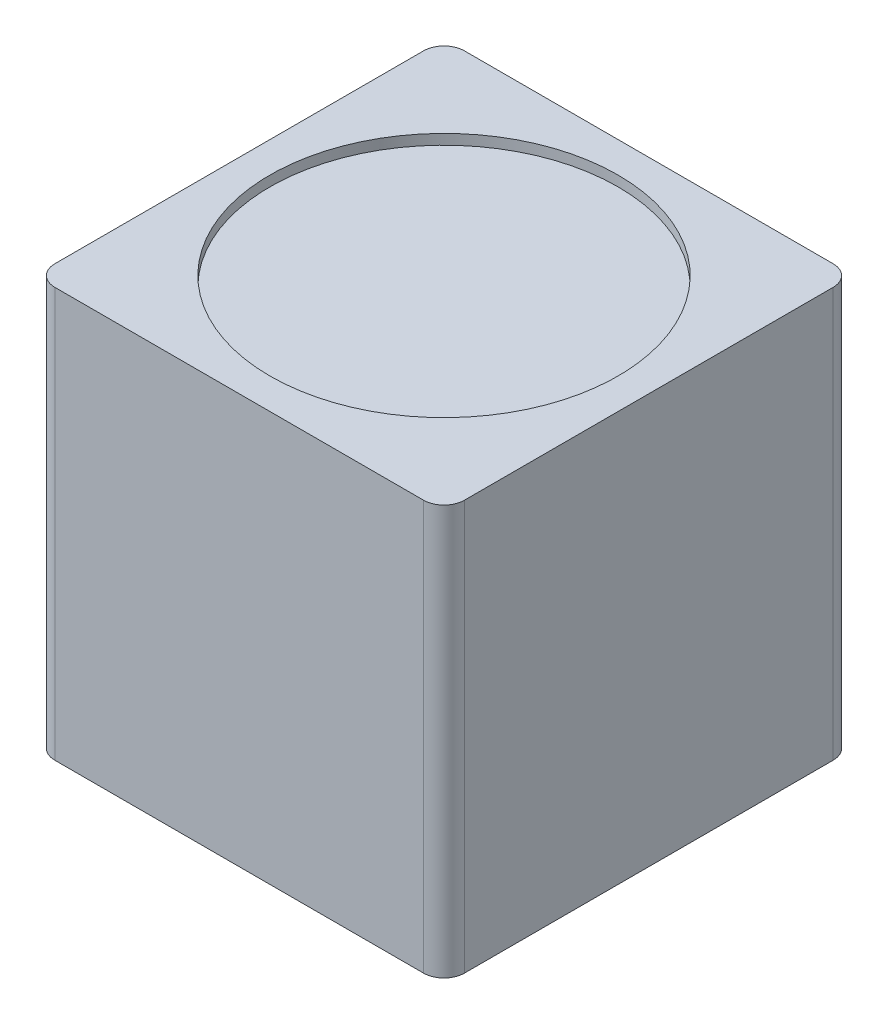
ISO-10303-21;
HEADER;
FILE_DESCRIPTION(('STEP AP214'),'2;1');
FILE_NAME('part.step','',(''),(''),'','','');
FILE_SCHEMA(('AUTOMOTIVE_DESIGN { 1 0 10303 214 1 1 1 1 }'));
ENDSEC;
DATA;
#1=APPLICATION_CONTEXT('core data for automotive mechanical design processes');
#2=APPLICATION_PROTOCOL_DEFINITION('international standard','automotive_design',2000,#1);
#3=PRODUCT_CONTEXT('',#1,'mechanical');
#4=PRODUCT('Part','Part','',(#3));
#5=PRODUCT_RELATED_PRODUCT_CATEGORY('part','',(#4));
#6=PRODUCT_DEFINITION_FORMATION('','',#4);
#7=PRODUCT_DEFINITION_CONTEXT('part definition',#1,'design');
#8=PRODUCT_DEFINITION('design','',#6,#7);
#9=PRODUCT_DEFINITION_SHAPE('','',#8);
#10=(LENGTH_UNIT() NAMED_UNIT(*) SI_UNIT(.MILLI.,.METRE.));
#11=(NAMED_UNIT(*) PLANE_ANGLE_UNIT() SI_UNIT($,.RADIAN.));
#12=(NAMED_UNIT(*) SI_UNIT($,.STERADIAN.) SOLID_ANGLE_UNIT());
#13=UNCERTAINTY_MEASURE_WITH_UNIT(LENGTH_MEASURE(1.E-05),#10,'distance_accuracy_value','');
#14=(GEOMETRIC_REPRESENTATION_CONTEXT(3) GLOBAL_UNCERTAINTY_ASSIGNED_CONTEXT((#13)) GLOBAL_UNIT_ASSIGNED_CONTEXT((#10,
#11,#12)) REPRESENTATION_CONTEXT('',''));
#15=CARTESIAN_POINT('',(0.,0.,0.));
#16=DIRECTION('',(0.,0.,1.));
#17=DIRECTION('',(1.,0.,0.));
#18=AXIS2_PLACEMENT_3D('',#15,#16,#17);
#19=CARTESIAN_POINT('',(0.,20.,20.));
#20=DIRECTION('',(1.,0.,0.));
#21=DIRECTION('',(0.,0.,-1.));
#22=AXIS2_PLACEMENT_3D('',#19,#20,#21);
#23=PLANE('',#22);
#24=DIRECTION('',(0.,0.,-1.));
#25=VECTOR('',#24,1.);
#26=CARTESIAN_POINT('',(0.,20.,20.));
#27=LINE('',#26,#25);
#28=CARTESIAN_POINT('',(0.,20.,19.));
#29=VERTEX_POINT('',#28);
#30=CARTESIAN_POINT('',(0.,20.,1.));
#31=VERTEX_POINT('',#30);
#32=EDGE_CURVE('E165',#29,#31,#27,.T.);
#33=ORIENTED_EDGE('',*,*,#32,.T.);
#34=DIRECTION('',(0.,-1.,0.));
#35=VECTOR('',#34,1.);
#36=CARTESIAN_POINT('',(0.,20.,1.));
#37=LINE('',#36,#35);
#38=CARTESIAN_POINT('',(0.,0.,1.));
#39=VERTEX_POINT('',#38);
#40=EDGE_CURVE('E128',#31,#39,#37,.T.);
#41=ORIENTED_EDGE('',*,*,#40,.T.);
#42=DIRECTION('',(0.,0.,-1.));
#43=VECTOR('',#42,1.);
#44=CARTESIAN_POINT('',(0.,0.,20.));
#45=LINE('',#44,#43);
#46=CARTESIAN_POINT('',(0.,0.,19.));
#47=VERTEX_POINT('',#46);
#48=EDGE_CURVE('E113',#47,#39,#45,.T.);
#49=ORIENTED_EDGE('',*,*,#48,.F.);
#50=DIRECTION('',(0.,-1.,0.));
#51=VECTOR('',#50,1.);
#52=CARTESIAN_POINT('',(0.,20.,19.));
#53=LINE('',#52,#51);
#54=EDGE_CURVE('E125',#47,#29,#53,.F.);
#55=ORIENTED_EDGE('',*,*,#54,.T.);
#56=EDGE_LOOP('',(#33,#41,#49,#55));
#57=FACE_BOUND('',#56,.T.);
#58=ADVANCED_FACE('F43',(#57),#23,.F.);
#59=CARTESIAN_POINT('',(0.,0.,20.));
#60=DIRECTION('',(0.,1.,0.));
#61=DIRECTION('',(0.,0.,1.));
#62=AXIS2_PLACEMENT_3D('',#59,#60,#61);
#63=PLANE('',#62);
#64=ORIENTED_EDGE('',*,*,#48,.T.);
#65=CARTESIAN_POINT('',(1.,0.,1.));
#66=DIRECTION('',(0.,1.,0.));
#67=DIRECTION('',(0.,0.,1.));
#68=AXIS2_PLACEMENT_3D('',#65,#66,#67);
#69=CIRCLE('',#68,1.);
#70=CARTESIAN_POINT('',(1.,0.,0.));
#71=VERTEX_POINT('',#70);
#72=EDGE_CURVE('E141',#39,#71,#69,.F.);
#73=ORIENTED_EDGE('',*,*,#72,.T.);
#74=DIRECTION('',(1.,0.,0.));
#75=VECTOR('',#74,1.);
#76=CARTESIAN_POINT('',(0.,0.,0.));
#77=LINE('',#76,#75);
#78=CARTESIAN_POINT('',(19.,0.,0.));
#79=VERTEX_POINT('',#78);
#80=EDGE_CURVE('E173',#71,#79,#77,.T.);
#81=ORIENTED_EDGE('',*,*,#80,.T.);
#82=CARTESIAN_POINT('',(19.,0.,1.));
#83=DIRECTION('',(0.,1.,0.));
#84=DIRECTION('',(0.,0.,1.));
#85=AXIS2_PLACEMENT_3D('',#82,#83,#84);
#86=CIRCLE('',#85,1.);
#87=CARTESIAN_POINT('',(20.,0.,1.));
#88=VERTEX_POINT('',#87);
#89=EDGE_CURVE('E119',#79,#88,#86,.F.);
#90=ORIENTED_EDGE('',*,*,#89,.T.);
#91=DIRECTION('',(0.,0.,-1.));
#92=VECTOR('',#91,1.);
#93=CARTESIAN_POINT('',(20.,0.,20.));
#94=LINE('',#93,#92);
#95=CARTESIAN_POINT('',(20.,0.,19.));
#96=VERTEX_POINT('',#95);
#97=EDGE_CURVE('E129',#96,#88,#94,.T.);
#98=ORIENTED_EDGE('',*,*,#97,.F.);
#99=CARTESIAN_POINT('',(19.,0.,19.));
#100=DIRECTION('',(0.,1.,0.));
#101=DIRECTION('',(0.,0.,1.));
#102=AXIS2_PLACEMENT_3D('',#99,#100,#101);
#103=CIRCLE('',#102,1.);
#104=CARTESIAN_POINT('',(19.,0.,20.));
#105=VERTEX_POINT('',#104);
#106=EDGE_CURVE('E120',#96,#105,#103,.F.);
#107=ORIENTED_EDGE('',*,*,#106,.T.);
#108=DIRECTION('',(1.,0.,0.));
#109=VECTOR('',#108,1.);
#110=CARTESIAN_POINT('',(0.,0.,20.));
#111=LINE('',#110,#109);
#112=CARTESIAN_POINT('',(1.,0.,20.));
#113=VERTEX_POINT('',#112);
#114=EDGE_CURVE('E115',#113,#105,#111,.T.);
#115=ORIENTED_EDGE('',*,*,#114,.F.);
#116=CARTESIAN_POINT('',(1.,0.,19.));
#117=DIRECTION('',(0.,1.,0.));
#118=DIRECTION('',(0.,0.,1.));
#119=AXIS2_PLACEMENT_3D('',#116,#117,#118);
#120=CIRCLE('',#119,1.);
#121=EDGE_CURVE('E110',#113,#47,#120,.F.);
#122=ORIENTED_EDGE('',*,*,#121,.T.);
#123=EDGE_LOOP('',(#64,#73,#81,#90,#98,#107,#115,#122));
#124=FACE_BOUND('',#123,.T.);
#125=ADVANCED_FACE('F112',(#124),#63,.F.);
#126=CARTESIAN_POINT('',(20.,0.,20.));
#127=DIRECTION('',(-1.,0.,0.));
#128=DIRECTION('',(0.,0.,1.));
#129=AXIS2_PLACEMENT_3D('',#126,#127,#128);
#130=PLANE('',#129);
#131=ORIENTED_EDGE('',*,*,#97,.T.);
#132=DIRECTION('',(0.,1.,0.));
#133=VECTOR('',#132,1.);
#134=CARTESIAN_POINT('',(20.,0.,1.));
#135=LINE('',#134,#133);
#136=CARTESIAN_POINT('',(20.,20.,1.));
#137=VERTEX_POINT('',#136);
#138=EDGE_CURVE('E154',#88,#137,#135,.T.);
#139=ORIENTED_EDGE('',*,*,#138,.T.);
#140=DIRECTION('',(0.,0.,-1.));
#141=VECTOR('',#140,1.);
#142=CARTESIAN_POINT('',(20.,20.,20.));
#143=LINE('',#142,#141);
#144=CARTESIAN_POINT('',(20.,20.,19.));
#145=VERTEX_POINT('',#144);
#146=EDGE_CURVE('E167',#145,#137,#143,.T.);
#147=ORIENTED_EDGE('',*,*,#146,.F.);
#148=DIRECTION('',(0.,1.,0.));
#149=VECTOR('',#148,1.);
#150=CARTESIAN_POINT('',(20.,0.,19.));
#151=LINE('',#150,#149);
#152=EDGE_CURVE('E152',#145,#96,#151,.F.);
#153=ORIENTED_EDGE('',*,*,#152,.T.);
#154=EDGE_LOOP('',(#131,#139,#147,#153));
#155=FACE_BOUND('',#154,.T.);
#156=ADVANCED_FACE('F181',(#155),#130,.F.);
#157=CARTESIAN_POINT('',(20.,20.,20.));
#158=DIRECTION('',(0.,-1.,0.));
#159=DIRECTION('',(0.,0.,-1.));
#160=AXIS2_PLACEMENT_3D('',#157,#158,#159);
#161=PLANE('',#160);
#162=CARTESIAN_POINT('',(10.,20.,10.));
#163=DIRECTION('',(0.,-1.,0.));
#164=DIRECTION('',(0.,0.,-1.));
#165=AXIS2_PLACEMENT_3D('',#162,#163,#164);
#166=CIRCLE('',#165,8.5);
#167=CARTESIAN_POINT('',(10.,20.,1.5));
#168=VERTEX_POINT('',#167);
#169=EDGE_CURVE('E137',#168,#168,#166,.F.);
#170=ORIENTED_EDGE('',*,*,#169,.F.);
#171=EDGE_LOOP('',(#170));
#172=FACE_BOUND('',#171,.T.);
#173=DIRECTION('',(-1.,0.,0.));
#174=VECTOR('',#173,1.);
#175=CARTESIAN_POINT('',(20.,20.,0.));
#176=LINE('',#175,#174);
#177=CARTESIAN_POINT('',(19.,20.,0.));
#178=VERTEX_POINT('',#177);
#179=CARTESIAN_POINT('',(1.,20.,0.));
#180=VERTEX_POINT('',#179);
#181=EDGE_CURVE('E169',#178,#180,#176,.T.);
#182=ORIENTED_EDGE('',*,*,#181,.T.);
#183=CARTESIAN_POINT('',(1.,20.,1.));
#184=DIRECTION('',(0.,-1.,0.));
#185=DIRECTION('',(0.,0.,-1.));
#186=AXIS2_PLACEMENT_3D('',#183,#184,#185);
#187=CIRCLE('',#186,1.);
#188=EDGE_CURVE('E150',#180,#31,#187,.F.);
#189=ORIENTED_EDGE('',*,*,#188,.T.);
#190=ORIENTED_EDGE('',*,*,#32,.F.);
#191=CARTESIAN_POINT('',(1.,20.,19.));
#192=DIRECTION('',(0.,-1.,0.));
#193=DIRECTION('',(0.,0.,-1.));
#194=AXIS2_PLACEMENT_3D('',#191,#192,#193);
#195=CIRCLE('',#194,1.);
#196=CARTESIAN_POINT('',(1.,20.,20.));
#197=VERTEX_POINT('',#196);
#198=EDGE_CURVE('E133',#29,#197,#195,.F.);
#199=ORIENTED_EDGE('',*,*,#198,.T.);
#200=DIRECTION('',(-1.,0.,0.));
#201=VECTOR('',#200,1.);
#202=CARTESIAN_POINT('',(20.,20.,20.));
#203=LINE('',#202,#201);
#204=CARTESIAN_POINT('',(19.,20.,20.));
#205=VERTEX_POINT('',#204);
#206=EDGE_CURVE('E160',#205,#197,#203,.T.);
#207=ORIENTED_EDGE('',*,*,#206,.F.);
#208=CARTESIAN_POINT('',(19.,20.,19.));
#209=DIRECTION('',(0.,-1.,0.));
#210=DIRECTION('',(0.,0.,-1.));
#211=AXIS2_PLACEMENT_3D('',#208,#209,#210);
#212=CIRCLE('',#211,1.);
#213=EDGE_CURVE('E66',#205,#145,#212,.F.);
#214=ORIENTED_EDGE('',*,*,#213,.T.);
#215=ORIENTED_EDGE('',*,*,#146,.T.);
#216=CARTESIAN_POINT('',(19.,20.,1.));
#217=DIRECTION('',(0.,-1.,0.));
#218=DIRECTION('',(0.,0.,-1.));
#219=AXIS2_PLACEMENT_3D('',#216,#217,#218);
#220=CIRCLE('',#219,1.);
#221=EDGE_CURVE('E58',#137,#178,#220,.F.);
#222=ORIENTED_EDGE('',*,*,#221,.T.);
#223=EDGE_LOOP('',(#182,#189,#190,#199,#207,#214,#215,#222));
#224=FACE_BOUND('',#223,.T.);
#225=ADVANCED_FACE('F164',(#172,#224),#161,.F.);
#226=CARTESIAN_POINT('',(0.,0.,20.));
#227=DIRECTION('',(0.,0.,1.));
#228=DIRECTION('',(1.,0.,0.));
#229=AXIS2_PLACEMENT_3D('',#226,#227,#228);
#230=PLANE('',#229);
#231=ORIENTED_EDGE('',*,*,#206,.T.);
#232=DIRECTION('',(0.,-1.,0.));
#233=VECTOR('',#232,1.);
#234=CARTESIAN_POINT('',(1.,0.,20.));
#235=LINE('',#234,#233);
#236=EDGE_CURVE('E11',#197,#113,#235,.T.);
#237=ORIENTED_EDGE('',*,*,#236,.T.);
#238=ORIENTED_EDGE('',*,*,#114,.T.);
#239=DIRECTION('',(0.,1.,0.));
#240=VECTOR('',#239,1.);
#241=CARTESIAN_POINT('',(19.,20.,20.));
#242=LINE('',#241,#240);
#243=EDGE_CURVE('E51',#105,#205,#242,.T.);
#244=ORIENTED_EDGE('',*,*,#243,.T.);
#245=EDGE_LOOP('',(#231,#237,#238,#244));
#246=FACE_BOUND('',#245,.T.);
#247=ADVANCED_FACE('F159',(#246),#230,.T.);
#248=CARTESIAN_POINT('',(0.,0.,0.));
#249=DIRECTION('',(0.,0.,1.));
#250=DIRECTION('',(1.,0.,0.));
#251=AXIS2_PLACEMENT_3D('',#248,#249,#250);
#252=PLANE('',#251);
#253=ORIENTED_EDGE('',*,*,#80,.F.);
#254=DIRECTION('',(0.,-1.,0.));
#255=VECTOR('',#254,1.);
#256=CARTESIAN_POINT('',(1.,0.,0.));
#257=LINE('',#256,#255);
#258=EDGE_CURVE('E145',#71,#180,#257,.F.);
#259=ORIENTED_EDGE('',*,*,#258,.T.);
#260=ORIENTED_EDGE('',*,*,#181,.F.);
#261=DIRECTION('',(0.,1.,0.));
#262=VECTOR('',#261,1.);
#263=CARTESIAN_POINT('',(19.,0.,0.));
#264=LINE('',#263,#262);
#265=EDGE_CURVE('E143',#178,#79,#264,.F.);
#266=ORIENTED_EDGE('',*,*,#265,.T.);
#267=EDGE_LOOP('',(#253,#259,#260,#266));
#268=FACE_BOUND('',#267,.T.);
#269=ADVANCED_FACE('F188',(#268),#252,.F.);
#270=CARTESIAN_POINT('',(10.,20.000012,10.));
#271=DIRECTION('',(0.,-1.,0.));
#272=DIRECTION('',(0.,0.,-1.));
#273=AXIS2_PLACEMENT_3D('',#270,#271,#272);
#274=CYLINDRICAL_SURFACE('',#273,8.5);
#275=CARTESIAN_POINT('',(10.,19.5,10.));
#276=DIRECTION('',(0.,1.,0.));
#277=DIRECTION('',(0.,0.,1.));
#278=AXIS2_PLACEMENT_3D('',#275,#276,#277);
#279=CIRCLE('',#278,8.5);
#280=CARTESIAN_POINT('',(10.,19.5,1.5));
#281=VERTEX_POINT('',#280);
#282=EDGE_CURVE('E293',#281,#281,#279,.T.);
#283=CARTESIAN_POINT('',(10.,19.5,1.5));
#284=CARTESIAN_POINT('',(10.,19.5052083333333,1.5));
#285=CARTESIAN_POINT('',(10.,19.5104166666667,1.5));
#286=CARTESIAN_POINT('',(10.,19.5208333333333,1.5));
#287=CARTESIAN_POINT('',(10.,19.5260416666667,1.5));
#288=CARTESIAN_POINT('',(10.,19.5364583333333,1.5));
#289=CARTESIAN_POINT('',(10.,19.5416666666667,1.5));
#290=CARTESIAN_POINT('',(10.,19.5520833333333,1.5));
#291=CARTESIAN_POINT('',(10.,19.5572916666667,1.5));
#292=CARTESIAN_POINT('',(10.,19.5677083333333,1.5));
#293=CARTESIAN_POINT('',(10.,19.5729166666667,1.5));
#294=CARTESIAN_POINT('',(10.,19.5833333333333,1.5));
#295=CARTESIAN_POINT('',(10.,19.5885416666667,1.5));
#296=CARTESIAN_POINT('',(10.,19.5989583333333,1.5));
#297=CARTESIAN_POINT('',(10.,19.6041666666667,1.5));
#298=CARTESIAN_POINT('',(10.,19.6145833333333,1.5));
#299=CARTESIAN_POINT('',(10.,19.6197916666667,1.5));
#300=CARTESIAN_POINT('',(10.,19.6302083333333,1.5));
#301=CARTESIAN_POINT('',(10.,19.6354166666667,1.5));
#302=CARTESIAN_POINT('',(10.,19.6458333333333,1.5));
#303=CARTESIAN_POINT('',(10.,19.6510416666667,1.5));
#304=CARTESIAN_POINT('',(10.,19.6614583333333,1.5));
#305=CARTESIAN_POINT('',(10.,19.6666666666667,1.5));
#306=CARTESIAN_POINT('',(10.,19.6770833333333,1.5));
#307=CARTESIAN_POINT('',(10.,19.6822916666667,1.5));
#308=CARTESIAN_POINT('',(10.,19.6927083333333,1.5));
#309=CARTESIAN_POINT('',(10.,19.6979166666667,1.5));
#310=CARTESIAN_POINT('',(10.,19.7083333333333,1.5));
#311=CARTESIAN_POINT('',(10.,19.7135416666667,1.5));
#312=CARTESIAN_POINT('',(10.,19.7239583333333,1.5));
#313=CARTESIAN_POINT('',(10.,19.7291666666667,1.5));
#314=CARTESIAN_POINT('',(10.,19.7395833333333,1.5));
#315=CARTESIAN_POINT('',(10.,19.7447916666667,1.5));
#316=CARTESIAN_POINT('',(10.,19.7552083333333,1.5));
#317=CARTESIAN_POINT('',(10.,19.7604166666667,1.5));
#318=CARTESIAN_POINT('',(10.,19.7708333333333,1.5));
#319=CARTESIAN_POINT('',(10.,19.7760416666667,1.5));
#320=CARTESIAN_POINT('',(10.,19.7864583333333,1.5));
#321=CARTESIAN_POINT('',(10.,19.7916666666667,1.5));
#322=CARTESIAN_POINT('',(10.,19.8020833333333,1.5));
#323=CARTESIAN_POINT('',(10.,19.8072916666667,1.5));
#324=CARTESIAN_POINT('',(10.,19.8177083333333,1.5));
#325=CARTESIAN_POINT('',(10.,19.8229166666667,1.5));
#326=CARTESIAN_POINT('',(10.,19.8333333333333,1.5));
#327=CARTESIAN_POINT('',(10.,19.8385416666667,1.5));
#328=CARTESIAN_POINT('',(10.,19.8489583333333,1.5));
#329=CARTESIAN_POINT('',(10.,19.8541666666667,1.5));
#330=CARTESIAN_POINT('',(10.,19.8645833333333,1.5));
#331=CARTESIAN_POINT('',(10.,19.8697916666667,1.5));
#332=CARTESIAN_POINT('',(10.,19.8802083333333,1.5));
#333=CARTESIAN_POINT('',(10.,19.8854166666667,1.5));
#334=CARTESIAN_POINT('',(10.,19.8958333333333,1.5));
#335=CARTESIAN_POINT('',(10.,19.9010416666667,1.5));
#336=CARTESIAN_POINT('',(10.,19.9114583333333,1.5));
#337=CARTESIAN_POINT('',(10.,19.9166666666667,1.5));
#338=CARTESIAN_POINT('',(10.,19.9270833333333,1.5));
#339=CARTESIAN_POINT('',(10.,19.9322916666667,1.5));
#340=CARTESIAN_POINT('',(10.,19.9427083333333,1.5));
#341=CARTESIAN_POINT('',(10.,19.9479166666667,1.5));
#342=CARTESIAN_POINT('',(10.,19.9583333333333,1.5));
#343=CARTESIAN_POINT('',(10.,19.9635416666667,1.5));
#344=CARTESIAN_POINT('',(10.,19.9739583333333,1.5));
#345=CARTESIAN_POINT('',(10.,19.9791666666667,1.5));
#346=CARTESIAN_POINT('',(10.,19.9895833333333,1.5));
#347=CARTESIAN_POINT('',(10.,19.9947916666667,1.5));
#348=CARTESIAN_POINT('',(10.,20.,1.5));
#349=B_SPLINE_CURVE_WITH_KNOTS('',3,(#283,#284,#285,#286,#287,#288,#289,#290,#291,#292,#293,
#294,#295,#296,#297,#298,#299,#300,#301,#302,#303,#304,#305,#306,#307,#308,#309,#310,#311,#312,
#313,#314,#315,#316,#317,#318,#319,#320,#321,#322,#323,#324,#325,#326,#327,#328,#329,#330,#331,
#332,#333,#334,#335,#336,#337,#338,#339,#340,#341,#342,#343,#344,#345,#346,#347,#348),
.UNSPECIFIED.,.F.,.F.,(4,2,2,2,2,2,2,2,2,2,2,2,2,2,2,2,2,2,2,2,2,2,2,2,2,2,2,2,2,2,2,2,4),(0.,
0.0156249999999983,0.03125,0.0468749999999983,0.0625000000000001,0.0781249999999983,
0.0937500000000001,0.109374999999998,0.125,0.140624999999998,0.15625,0.171874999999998,0.1875,
0.203124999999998,0.21875,0.234374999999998,0.25,0.265625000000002,0.28125,0.296875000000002,
0.3125,0.328125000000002,0.34375,0.359375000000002,0.375,0.390625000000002,0.40625,
0.421875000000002,0.4375,0.453125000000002,0.46875,0.484375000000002,0.500000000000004),.UNSPECIFIED.);
#350=EDGE_CURVE('BSEAM237',#281,#168,#349,.T.);
#351=ORIENTED_EDGE('',*,*,#282,.F.);
#352=ORIENTED_EDGE('',*,*,#169,.T.);
#353=ORIENTED_EDGE('',*,*,#350,.T.);
#354=ORIENTED_EDGE('',*,*,#350,.F.);
#355=EDGE_LOOP('',(#351,#353,#352,#354));
#356=FACE_BOUND('',#355,.T.);
#357=ADVANCED_FACE('F237',(#356),#274,.F.);
#358=CARTESIAN_POINT('',(10.,19.5,10.));
#359=DIRECTION('',(0.,1.,0.));
#360=DIRECTION('',(0.,0.,1.));
#361=AXIS2_PLACEMENT_3D('',#358,#359,#360);
#362=PLANE('',#361);
#363=ORIENTED_EDGE('',*,*,#282,.T.);
#364=EDGE_LOOP('',(#363));
#365=FACE_BOUND('',#364,.T.);
#366=ADVANCED_FACE('F208',(#365),#362,.T.);
#367=CARTESIAN_POINT('',(1.,20.,1.));
#368=DIRECTION('',(0.,-1.,0.));
#369=DIRECTION('',(0.,0.,-1.));
#370=AXIS2_PLACEMENT_3D('',#367,#368,#369);
#371=CYLINDRICAL_SURFACE('',#370,1.);
#372=ORIENTED_EDGE('',*,*,#188,.F.);
#373=ORIENTED_EDGE('',*,*,#258,.F.);
#374=ORIENTED_EDGE('',*,*,#72,.F.);
#375=ORIENTED_EDGE('',*,*,#40,.F.);
#376=EDGE_LOOP('',(#372,#373,#374,#375));
#377=FACE_BOUND('',#376,.T.);
#378=ADVANCED_FACE('F192',(#377),#371,.T.);
#379=CARTESIAN_POINT('',(19.,0.,1.));
#380=DIRECTION('',(0.,1.,0.));
#381=DIRECTION('',(0.,0.,1.));
#382=AXIS2_PLACEMENT_3D('',#379,#380,#381);
#383=CYLINDRICAL_SURFACE('',#382,1.);
#384=ORIENTED_EDGE('',*,*,#89,.F.);
#385=ORIENTED_EDGE('',*,*,#265,.F.);
#386=ORIENTED_EDGE('',*,*,#221,.F.);
#387=ORIENTED_EDGE('',*,*,#138,.F.);
#388=EDGE_LOOP('',(#384,#385,#386,#387));
#389=FACE_BOUND('',#388,.T.);
#390=ADVANCED_FACE('F184',(#389),#383,.T.);
#391=CARTESIAN_POINT('',(1.,0.,19.));
#392=DIRECTION('',(0.,1.,0.));
#393=DIRECTION('',(0.,0.,1.));
#394=AXIS2_PLACEMENT_3D('',#391,#392,#393);
#395=CYLINDRICAL_SURFACE('',#394,1.);
#396=ORIENTED_EDGE('',*,*,#198,.F.);
#397=ORIENTED_EDGE('',*,*,#54,.F.);
#398=ORIENTED_EDGE('',*,*,#121,.F.);
#399=ORIENTED_EDGE('',*,*,#236,.F.);
#400=EDGE_LOOP('',(#396,#397,#398,#399));
#401=FACE_BOUND('',#400,.T.);
#402=ADVANCED_FACE('F132',(#401),#395,.T.);
#403=CARTESIAN_POINT('',(19.,0.,19.));
#404=DIRECTION('',(0.,-1.,0.));
#405=DIRECTION('',(0.,0.,-1.));
#406=AXIS2_PLACEMENT_3D('',#403,#404,#405);
#407=CYLINDRICAL_SURFACE('',#406,1.);
#408=ORIENTED_EDGE('',*,*,#106,.F.);
#409=ORIENTED_EDGE('',*,*,#152,.F.);
#410=ORIENTED_EDGE('',*,*,#213,.F.);
#411=ORIENTED_EDGE('',*,*,#243,.F.);
#412=EDGE_LOOP('',(#408,#409,#410,#411));
#413=FACE_BOUND('',#412,.T.);
#414=ADVANCED_FACE('F45',(#413),#407,.T.);
#415=CLOSED_SHELL('',(#58,#125,#156,#225,#247,#269,#357,#366,#378,#390,#402,#414));
#416=MANIFOLD_SOLID_BREP('B2',#415);
#417=ADVANCED_BREP_SHAPE_REPRESENTATION('',(#18,#416),#14);
#418=SHAPE_DEFINITION_REPRESENTATION(#9,#417);
ENDSEC;
END-ISO-10303-21;
